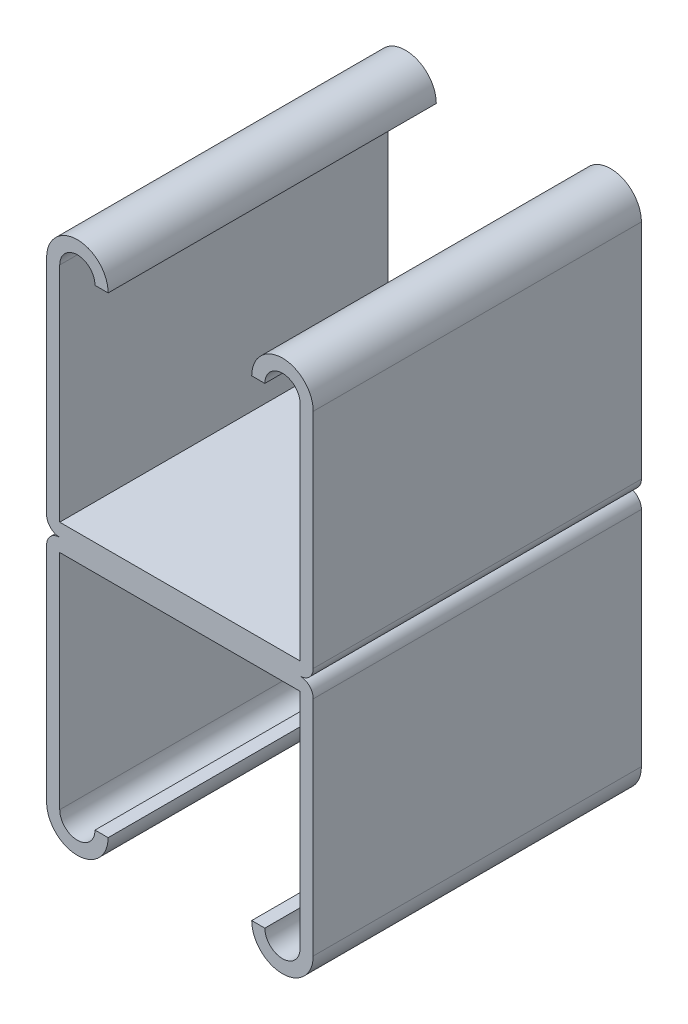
from build123d import *

# Parameters (mm, degrees)
BASE_EXTRUDE_DEPTH = 12.7


with BuildPart() as part:
    # Sketch1 → Base-Extrude (new, symmetric)
    with BuildSketch(Plane.XY):
        with BuildLine():
            Line((-10.31875, 18.25625), (-10.31875, 1.016))
            ThreePointArc((-10.31875, 1.016), (-10.02117049, 0.29757951), (-9.30275, 0))
            Line((-9.30275, 0), (9.30275, 0))
            ThreePointArc((9.30275, 0), (10.02117049, 0.29757951), (10.31875, 1.016))
            Line((10.31875, 1.016), (10.31875, 18.25625))
            ThreePointArc((10.31875, 18.25625), (7.9375, 20.6375), (5.55625, 18.25625))
            Line((5.55625, 18.25625), (6.57225, 18.25625))
            ThreePointArc((6.57225, 18.25625), (7.9375, 19.6215), (9.30275, 18.25625))
            Line((9.30275, 18.25625), (9.30275, 1.016))
            Line((9.30275, 1.016), (-9.30275, 1.016))
            Line((-9.30275, 1.016), (-9.30275, 18.25625))
            ThreePointArc((-9.30275, 18.25625), (-7.9375, 19.6215), (-6.57225, 18.25625))
            Line((-6.57225, 18.25625), (-5.55625, 18.25625))
            ThreePointArc((-5.55625, 18.25625), (-7.9375, 20.6375), (-10.31875, 18.25625))
        make_face()
    base_extrude = extrude(amount=BASE_EXTRUDE_DEPTH, both=True)

    # Mirror1: Base-Extrude across plane
    add(base_extrude.mirror(Plane.ZX))


solid = part.part
